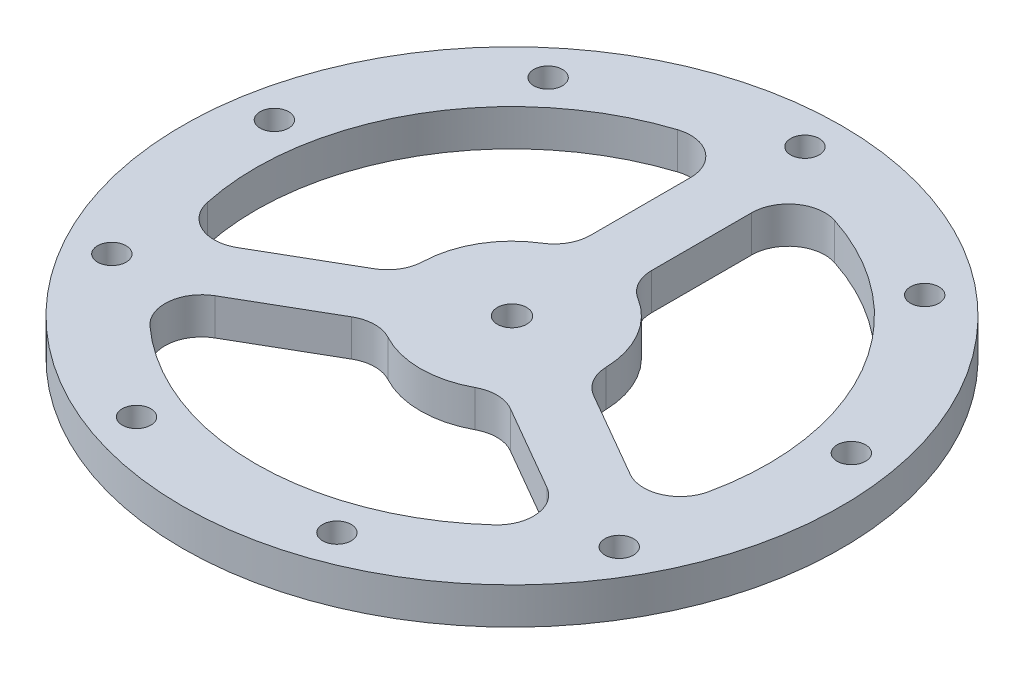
from build123d import *

# Parameters (mm, degrees)
SKETCH1_R               = 45
BOSS_EXTRUDE1_DEPTH     = 5
CUT_EXTRUDE1_DEPTH      = 64.835726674
CUT_EXTRUDE1_DEPTH_BACK = 64.835726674
SKETCH2_R               = 2
CUT_EXTRUDE2_DEPTH      = 64.835726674
CUT_EXTRUDE2_DEPTH_BACK = 64.835726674
FILLET1_R               = 5
FILLET2_R               = 5
SKETCH5_R               = 1.95
CUT_EXTRUDE3_DEPTH      = 64.835726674
CIRPATTERN1_COUNT       = 9


with BuildPart() as part:
    # Sketch1 → Boss-Extrude1 (new body)
    with BuildSketch(Plane(origin=(0, 0, 0), x_dir=(1, 0, 0), z_dir=(0, 1, 0))):
        with Locations(Location((0, 0, 0), (0, 0, 270))):
            Circle(SKETCH1_R)
    extrude(amount=BOSS_EXTRUDE1_DEPTH)

    # Sketch2 → Cut-Extrude1 (cut, two sides: drawn at the far end of the back side and taken through both)
    with BuildSketch(Plane(origin=(0, 5, 0), x_dir=(1, 0, 0), z_dir=(0, 1, 0)).offset(-CUT_EXTRUDE1_DEPTH_BACK)):
        with Locations(Location((0, 0, 0), (0, 0, 270))):
            Circle(SKETCH2_R)
    extrude(amount=CUT_EXTRUDE1_DEPTH + CUT_EXTRUDE1_DEPTH_BACK, mode=Mode.SUBTRACT)

    # Sketch4 → Cut-Extrude2 (cut, two sides: drawn at the far end of the back side and taken through both)
    with BuildSketch(Plane(origin=(0, 5, 0), x_dir=(1, 0, 0), z_dir=(0, 1, 0)).offset(-CUT_EXTRUDE2_DEPTH_BACK)):
        with BuildLine():
            Line((4.166666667, 34.751099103), (4.166666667, 11.78511302))
            ThreePointArc((4.166666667, 11.78511302), (10.206207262, 7.216878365), (12.5, 0))
            ThreePointArc((12.5, 0), (12.447273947, -1.146896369), (12.289540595, -2.284117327))
            Line((12.289540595, -2.284117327), (32.178667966, -13.767110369))
            ThreePointArc((32.178667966, -13.767110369), (34.287412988, -7.026614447), (35, 0))
            ThreePointArc((35, 0), (26.180463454, 23.228933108), (4.166666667, 34.751099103))
        make_face()
        with BuildLine():
            ThreePointArc((-12.289540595, -2.284117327), (-10.825317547, 6.25), (-4.166666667, 11.78511302))
            Line((-4.166666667, 11.78511302), (-4.166666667, 34.751099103))
            ThreePointArc((-4.166666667, 34.751099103), (-26.180463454, 23.228933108), (-35, 0))
            ThreePointArc((-35, 0), (-34.287412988, -7.026614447), (-32.178667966, -13.767110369))
            Line((-32.178667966, -13.767110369), (-12.289540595, -2.284117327))
        make_face()
        with BuildLine():
            ThreePointArc((8.122873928, -9.500995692), (0, -12.5), (-8.122873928, -9.500995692))
            Line((-8.122873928, -9.500995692), (-28.0120013, -20.983988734))
            ThreePointArc((-28.0120013, -20.983988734), (0, -35), (28.0120013, -20.983988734))
            Line((28.0120013, -20.983988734), (8.122873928, -9.500995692))
        make_face()
    extrude(amount=CUT_EXTRUDE2_DEPTH + CUT_EXTRUDE2_DEPTH_BACK, mode=Mode.SUBTRACT)

    # Fillet1
    fillet1_edges = [part.edges().sort_by_distance(p)[0] for p in [
        (-32.178667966, 2.5, 13.767110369),
        (-4.166666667, 2.5, -34.751099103),
        (28.0120013, 2.5, 20.983988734),
        (-28.0120013, 2.5, 20.983988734),
        (4.166666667, 2.5, -34.751099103),
        (32.178667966, 2.5, 13.767110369),
    ]]
    fillet(fillet1_edges, radius=FILLET1_R)

    # Fillet2
    fillet2_edges = [part.edges().sort_by_distance(p)[0] for p in [
        (-4.166666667, 2.5, -11.78511302),
        (-12.289540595, 2.5, 2.284117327),
        (-8.122873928, 2.5, 9.500995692),
        (8.122873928, 2.5, 9.500995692),
        (12.289540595, 2.5, 2.284117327),
        (4.166666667, 2.5, -11.78511302),
    ]]
    fillet(fillet2_edges, radius=FILLET2_R)

    # Sketch5 → Cut-Extrude3 (cut, through all)
    with BuildSketch(Plane(origin=(0, 5, 0), x_dir=(1, 0, 0), z_dir=(0, 1, 0))):
        with Locations(Location((0, 40, 0), (0, 0, 270))):
            Circle(SKETCH5_R)
    cut_extrude3 = extrude(amount=-CUT_EXTRUDE3_DEPTH, mode=Mode.SUBTRACT)

    # CirPattern1: Cut-Extrude3 ×9 about axis
    cirpattern1_axis = Axis((0, 0, 0), (0, 1, 0))
    for i in range(1, CIRPATTERN1_COUNT):
        add(cut_extrude3.rotate(cirpattern1_axis, i * 360 / CIRPATTERN1_COUNT), mode=Mode.SUBTRACT)


solid = part.part
